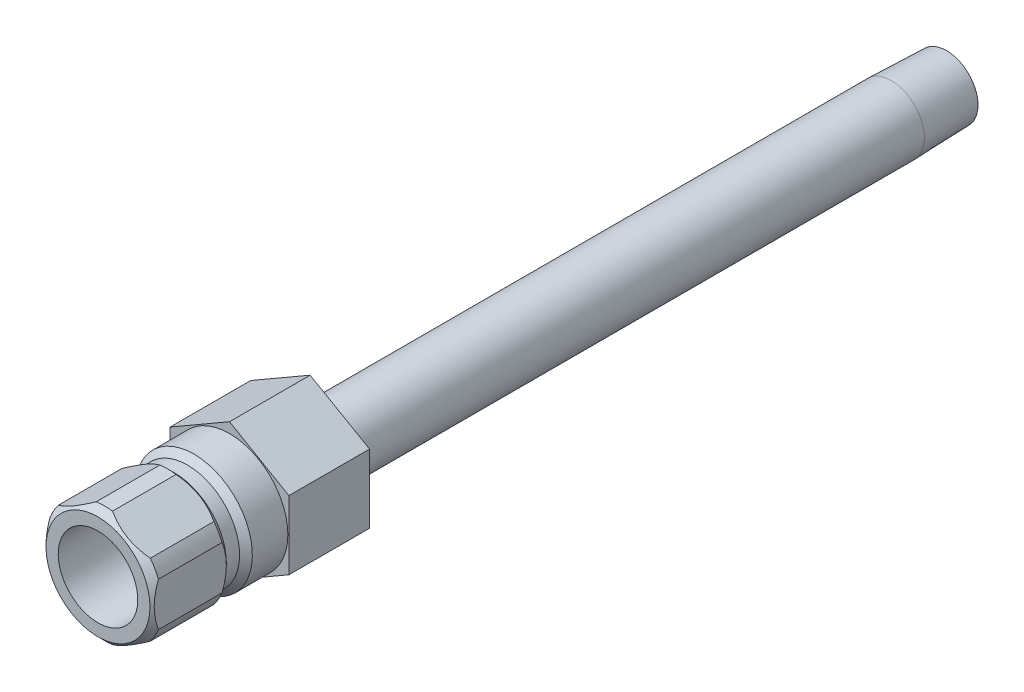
ISO-10303-21;
HEADER;
FILE_DESCRIPTION(('STEP AP214'),'2;1');
FILE_NAME('part.step','',(''),(''),'','','');
FILE_SCHEMA(('AUTOMOTIVE_DESIGN { 1 0 10303 214 1 1 1 1 }'));
ENDSEC;
DATA;
#1=APPLICATION_CONTEXT('core data for automotive mechanical design processes');
#2=APPLICATION_PROTOCOL_DEFINITION('international standard','automotive_design',2000,#1);
#3=PRODUCT_CONTEXT('',#1,'mechanical');
#4=PRODUCT('Part','Part','',(#3));
#5=PRODUCT_RELATED_PRODUCT_CATEGORY('part','',(#4));
#6=PRODUCT_DEFINITION_FORMATION('','',#4);
#7=PRODUCT_DEFINITION_CONTEXT('part definition',#1,'design');
#8=PRODUCT_DEFINITION('design','',#6,#7);
#9=PRODUCT_DEFINITION_SHAPE('','',#8);
#10=(LENGTH_UNIT() NAMED_UNIT(*) SI_UNIT(.MILLI.,.METRE.));
#11=(NAMED_UNIT(*) PLANE_ANGLE_UNIT() SI_UNIT($,.RADIAN.));
#12=(NAMED_UNIT(*) SI_UNIT($,.STERADIAN.) SOLID_ANGLE_UNIT());
#13=UNCERTAINTY_MEASURE_WITH_UNIT(LENGTH_MEASURE(1.E-05),#10,'distance_accuracy_value','');
#14=(GEOMETRIC_REPRESENTATION_CONTEXT(3) GLOBAL_UNCERTAINTY_ASSIGNED_CONTEXT((#13)) GLOBAL_UNIT_ASSIGNED_CONTEXT((#10,
#11,#12)) REPRESENTATION_CONTEXT('',''));
#15=CARTESIAN_POINT('',(0.,0.,0.));
#16=DIRECTION('',(0.,0.,1.));
#17=DIRECTION('',(1.,0.,0.));
#18=AXIS2_PLACEMENT_3D('',#15,#16,#17);
#19=CARTESIAN_POINT('',(0.,0.,-9.652));
#20=DIRECTION('',(0.,0.,-1.));
#21=DIRECTION('',(0.,1.,0.));
#22=AXIS2_PLACEMENT_3D('',#19,#20,#21);
#23=CYLINDRICAL_SURFACE('',#22,6.985);
#24=DIRECTION('',(0.,0.,-1.));
#25=VECTOR('',#24,1.);
#26=CARTESIAN_POINT('',(6.477,2.61509005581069,-9.652));
#27=LINE('',#26,#25);
#28=CARTESIAN_POINT('',(6.477,2.61509005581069,7.366));
#29=VERTEX_POINT('',#28);
#30=CARTESIAN_POINT('',(6.477,2.61509005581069,14.986));
#31=VERTEX_POINT('',#30);
#32=EDGE_CURVE('E381',#29,#31,#27,.F.);
#33=ORIENTED_EDGE('',*,*,#32,.F.);
#34=CARTESIAN_POINT('',(0.,0.,7.366));
#35=DIRECTION('',(0.,0.,-1.));
#36=DIRECTION('',(0.,1.,0.));
#37=AXIS2_PLACEMENT_3D('',#34,#35,#36);
#38=CIRCLE('',#37,6.985);
#39=CARTESIAN_POINT('',(5.50323442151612,4.30170151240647,7.366));
#40=VERTEX_POINT('',#39);
#41=EDGE_CURVE('E190',#40,#29,#38,.T.);
#42=ORIENTED_EDGE('',*,*,#41,.F.);
#43=DIRECTION('',(0.,0.,-1.));
#44=VECTOR('',#43,1.);
#45=CARTESIAN_POINT('',(5.50323442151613,4.30170151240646,-9.652));
#46=LINE('',#45,#44);
#47=CARTESIAN_POINT('',(5.50323442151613,4.30170151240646,14.986));
#48=VERTEX_POINT('',#47);
#49=EDGE_CURVE('E372',#48,#40,#46,.T.);
#50=ORIENTED_EDGE('',*,*,#49,.F.);
#51=CARTESIAN_POINT('',(0.,0.,14.986));
#52=DIRECTION('',(0.,0.,-1.));
#53=DIRECTION('',(0.,1.,0.));
#54=AXIS2_PLACEMENT_3D('',#51,#52,#53);
#55=CIRCLE('',#54,6.985);
#56=EDGE_CURVE('E205',#48,#31,#55,.T.);
#57=ORIENTED_EDGE('',*,*,#56,.T.);
#58=EDGE_LOOP('',(#33,#42,#50,#57));
#59=FACE_BOUND('',#58,.T.);
#60=ADVANCED_FACE('F34',(#59),#23,.T.);
#61=DIRECTION('',(0.,0.,-1.));
#62=VECTOR('',#61,1.);
#63=CARTESIAN_POINT('',(0.973765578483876,6.91679156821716,-9.652));
#64=LINE('',#63,#62);
#65=CARTESIAN_POINT('',(0.973765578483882,6.91679156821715,7.366));
#66=VERTEX_POINT('',#65);
#67=CARTESIAN_POINT('',(0.973765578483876,6.91679156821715,14.986));
#68=VERTEX_POINT('',#67);
#69=EDGE_CURVE('E291',#66,#68,#64,.F.);
#70=ORIENTED_EDGE('',*,*,#69,.F.);
#71=CARTESIAN_POINT('',(-0.973765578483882,6.91679156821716,7.366));
#72=VERTEX_POINT('',#71);
#73=EDGE_CURVE('E194',#72,#66,#38,.T.);
#74=ORIENTED_EDGE('',*,*,#73,.F.);
#75=DIRECTION('',(0.,0.,-1.));
#76=VECTOR('',#75,1.);
#77=CARTESIAN_POINT('',(-0.973765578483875,6.91679156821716,-9.652));
#78=LINE('',#77,#76);
#79=CARTESIAN_POINT('',(-0.973765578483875,6.91679156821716,14.986));
#80=VERTEX_POINT('',#79);
#81=EDGE_CURVE('E54',#80,#72,#78,.T.);
#82=ORIENTED_EDGE('',*,*,#81,.F.);
#83=EDGE_CURVE('E193',#80,#68,#55,.T.);
#84=ORIENTED_EDGE('',*,*,#83,.T.);
#85=EDGE_LOOP('',(#70,#74,#82,#84));
#86=FACE_BOUND('',#85,.T.);
#87=ADVANCED_FACE('F325',(#86),#23,.T.);
#88=DIRECTION('',(0.,0.,-1.));
#89=VECTOR('',#88,1.);
#90=CARTESIAN_POINT('',(-5.50323442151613,4.30170151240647,-9.652));
#91=LINE('',#90,#89);
#92=CARTESIAN_POINT('',(-5.50323442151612,4.30170151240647,7.366));
#93=VERTEX_POINT('',#92);
#94=CARTESIAN_POINT('',(-5.50323442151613,4.30170151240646,14.986));
#95=VERTEX_POINT('',#94);
#96=EDGE_CURVE('E370',#93,#95,#91,.F.);
#97=ORIENTED_EDGE('',*,*,#96,.F.);
#98=CARTESIAN_POINT('',(-6.477,2.6150900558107,7.366));
#99=VERTEX_POINT('',#98);
#100=EDGE_CURVE('E199',#99,#93,#38,.T.);
#101=ORIENTED_EDGE('',*,*,#100,.F.);
#102=DIRECTION('',(0.,0.,-1.));
#103=VECTOR('',#102,1.);
#104=CARTESIAN_POINT('',(-6.477,2.6150900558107,-9.652));
#105=LINE('',#104,#103);
#106=CARTESIAN_POINT('',(-6.477,2.61509005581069,14.986));
#107=VERTEX_POINT('',#106);
#108=EDGE_CURVE('E62',#107,#99,#105,.T.);
#109=ORIENTED_EDGE('',*,*,#108,.F.);
#110=EDGE_CURVE('E204',#107,#95,#55,.T.);
#111=ORIENTED_EDGE('',*,*,#110,.T.);
#112=EDGE_LOOP('',(#97,#101,#109,#111));
#113=FACE_BOUND('',#112,.T.);
#114=ADVANCED_FACE('F330',(#113),#23,.T.);
#115=DIRECTION('',(0.,0.,-1.));
#116=VECTOR('',#115,1.);
#117=CARTESIAN_POINT('',(-6.477,-2.6150900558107,-9.652));
#118=LINE('',#117,#116);
#119=CARTESIAN_POINT('',(-6.477,-2.6150900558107,7.366));
#120=VERTEX_POINT('',#119);
#121=CARTESIAN_POINT('',(-6.477,-2.6150900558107,14.986));
#122=VERTEX_POINT('',#121);
#123=EDGE_CURVE('E362',#120,#122,#118,.F.);
#124=ORIENTED_EDGE('',*,*,#123,.F.);
#125=CARTESIAN_POINT('',(-5.50323442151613,-4.30170151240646,7.366));
#126=VERTEX_POINT('',#125);
#127=EDGE_CURVE('E195',#126,#120,#38,.T.);
#128=ORIENTED_EDGE('',*,*,#127,.F.);
#129=DIRECTION('',(0.,0.,-1.));
#130=VECTOR('',#129,1.);
#131=CARTESIAN_POINT('',(-5.50323442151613,-4.30170151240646,-9.652));
#132=LINE('',#131,#130);
#133=CARTESIAN_POINT('',(-5.50323442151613,-4.30170151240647,14.986));
#134=VERTEX_POINT('',#133);
#135=EDGE_CURVE('E245',#134,#126,#132,.T.);
#136=ORIENTED_EDGE('',*,*,#135,.F.);
#137=EDGE_CURVE('E376',#134,#122,#55,.T.);
#138=ORIENTED_EDGE('',*,*,#137,.T.);
#139=EDGE_LOOP('',(#124,#128,#136,#138));
#140=FACE_BOUND('',#139,.T.);
#141=ADVANCED_FACE('F340',(#140),#23,.T.);
#142=DIRECTION('',(0.,0.,-1.));
#143=VECTOR('',#142,1.);
#144=CARTESIAN_POINT('',(-0.97376557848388,-6.91679156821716,-9.652));
#145=LINE('',#144,#143);
#146=CARTESIAN_POINT('',(-0.973765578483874,-6.91679156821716,7.366));
#147=VERTEX_POINT('',#146);
#148=CARTESIAN_POINT('',(-0.97376557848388,-6.91679156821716,14.986));
#149=VERTEX_POINT('',#148);
#150=EDGE_CURVE('E351',#147,#149,#145,.F.);
#151=ORIENTED_EDGE('',*,*,#150,.F.);
#152=CARTESIAN_POINT('',(0.973765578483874,-6.91679156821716,7.366));
#153=VERTEX_POINT('',#152);
#154=EDGE_CURVE('E191',#153,#147,#38,.T.);
#155=ORIENTED_EDGE('',*,*,#154,.F.);
#156=DIRECTION('',(0.,0.,-1.));
#157=VECTOR('',#156,1.);
#158=CARTESIAN_POINT('',(0.973765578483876,-6.91679156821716,-9.652));
#159=LINE('',#158,#157);
#160=CARTESIAN_POINT('',(0.973765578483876,-6.91679156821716,14.986));
#161=VERTEX_POINT('',#160);
#162=EDGE_CURVE('E168',#161,#153,#159,.T.);
#163=ORIENTED_EDGE('',*,*,#162,.F.);
#164=EDGE_CURVE('E353',#161,#149,#55,.T.);
#165=ORIENTED_EDGE('',*,*,#164,.T.);
#166=EDGE_LOOP('',(#151,#155,#163,#165));
#167=FACE_BOUND('',#166,.T.);
#168=ADVANCED_FACE('F334',(#167),#23,.T.);
#169=CARTESIAN_POINT('',(0.,0.,-9.652));
#170=DIRECTION('',(0.,0.,-1.));
#171=DIRECTION('',(0.,1.,0.));
#172=AXIS2_PLACEMENT_3D('',#169,#170,#171);
#173=CYLINDRICAL_SURFACE('',#172,2.65430000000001);
#174=CARTESIAN_POINT('',(0.,0.,2.43505017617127));
#175=DIRECTION('',(0.,0.,-1.));
#176=DIRECTION('',(0.,1.,0.));
#177=AXIS2_PLACEMENT_3D('',#174,#175,#176);
#178=CIRCLE('',#177,2.6543);
#179=CARTESIAN_POINT('',(0.,2.6543,2.43505017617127));
#180=VERTEX_POINT('',#179);
#181=EDGE_CURVE('E215',#180,#180,#178,.T.);
#182=ORIENTED_EDGE('',*,*,#181,.F.);
#183=EDGE_LOOP('',(#182));
#184=FACE_BOUND('',#183,.T.);
#185=CARTESIAN_POINT('',(0.,0.,-85.852));
#186=DIRECTION('',(0.,0.,-1.));
#187=DIRECTION('',(0.,1.,0.));
#188=AXIS2_PLACEMENT_3D('',#185,#186,#187);
#189=CIRCLE('',#188,2.65430000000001);
#190=CARTESIAN_POINT('',(0.,2.65430000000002,-85.852));
#191=VERTEX_POINT('',#190);
#192=EDGE_CURVE('E429',#191,#191,#189,.T.);
#193=ORIENTED_EDGE('',*,*,#192,.T.);
#194=EDGE_LOOP('',(#193));
#195=FACE_BOUND('',#194,.T.);
#196=ADVANCED_FACE('F36',(#184,#195),#173,.F.);
#197=CARTESIAN_POINT('',(0.,0.,3.556));
#198=DIRECTION('',(0.,0.,1.));
#199=DIRECTION('',(0.,-1.,0.));
#200=AXIS2_PLACEMENT_3D('',#197,#198,#199);
#201=CONICAL_SURFACE('',#200,4.7625,1.08210413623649);
#202=ORIENTED_EDGE('',*,*,#181,.T.);
#203=EDGE_LOOP('',(#202));
#204=FACE_BOUND('',#203,.T.);
#205=CARTESIAN_POINT('',(0.,0.,3.556));
#206=DIRECTION('',(0.,0.,-1.));
#207=DIRECTION('',(0.,1.,0.));
#208=AXIS2_PLACEMENT_3D('',#205,#206,#207);
#209=CIRCLE('',#208,4.7625);
#210=CARTESIAN_POINT('',(0.,4.7625,3.556));
#211=VERTEX_POINT('',#210);
#212=EDGE_CURVE('E212',#211,#211,#209,.T.);
#213=ORIENTED_EDGE('',*,*,#212,.F.);
#214=EDGE_LOOP('',(#213));
#215=FACE_BOUND('',#214,.T.);
#216=ADVANCED_FACE('F346',(#204,#215),#201,.F.);
#217=CARTESIAN_POINT('',(0.,0.,-9.652));
#218=DIRECTION('',(0.,0.,-1.));
#219=DIRECTION('',(0.,1.,0.));
#220=AXIS2_PLACEMENT_3D('',#217,#218,#219);
#221=CYLINDRICAL_SURFACE('',#220,4.7625);
#222=ORIENTED_EDGE('',*,*,#212,.T.);
#223=EDGE_LOOP('',(#222));
#224=FACE_BOUND('',#223,.T.);
#225=CARTESIAN_POINT('',(0.,0.,15.748));
#226=DIRECTION('',(0.,0.,-1.));
#227=DIRECTION('',(0.,1.,0.));
#228=AXIS2_PLACEMENT_3D('',#225,#226,#227);
#229=CIRCLE('',#228,4.7625);
#230=CARTESIAN_POINT('',(0.,4.7625,15.748));
#231=VERTEX_POINT('',#230);
#232=EDGE_CURVE('E209',#231,#231,#229,.T.);
#233=ORIENTED_EDGE('',*,*,#232,.F.);
#234=EDGE_LOOP('',(#233));
#235=FACE_BOUND('',#234,.T.);
#236=ADVANCED_FACE('F671',(#224,#235),#221,.F.);
#237=CARTESIAN_POINT('',(0.,4.7625,15.748));
#238=DIRECTION('',(0.,0.,1.));
#239=DIRECTION('',(0.,-1.,0.));
#240=AXIS2_PLACEMENT_3D('',#237,#238,#239);
#241=PLANE('',#240);
#242=ORIENTED_EDGE('',*,*,#232,.T.);
#243=EDGE_LOOP('',(#242));
#244=FACE_BOUND('',#243,.T.);
#245=CARTESIAN_POINT('',(0.,0.,15.748));
#246=DIRECTION('',(0.,0.,-1.));
#247=DIRECTION('',(0.,1.,0.));
#248=AXIS2_PLACEMENT_3D('',#245,#246,#247);
#249=CIRCLE('',#248,6.223);
#250=CARTESIAN_POINT('',(0.,6.223,15.748));
#251=VERTEX_POINT('',#250);
#252=EDGE_CURVE('E206',#251,#251,#249,.T.);
#253=ORIENTED_EDGE('',*,*,#252,.F.);
#254=EDGE_LOOP('',(#253));
#255=FACE_BOUND('',#254,.T.);
#256=ADVANCED_FACE('F252',(#244,#255),#241,.T.);
#257=CARTESIAN_POINT('',(0.,0.,14.986));
#258=DIRECTION('',(0.,0.,-1.));
#259=DIRECTION('',(0.,1.,0.));
#260=AXIS2_PLACEMENT_3D('',#257,#258,#259);
#261=CONICAL_SURFACE('',#260,6.985,0.785398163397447);
#262=CARTESIAN_POINT('',(6.477,-7.50531717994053,12.0573066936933));
#263=CARTESIAN_POINT('',(6.477,-7.32278230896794,12.1954662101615));
#264=CARTESIAN_POINT('',(6.477,-7.13923073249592,12.3323042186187));
#265=CARTESIAN_POINT('',(6.477,-6.76969107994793,12.6027438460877));
#266=CARTESIAN_POINT('',(6.477,-6.58370240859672,12.7363446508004));
#267=CARTESIAN_POINT('',(6.477,-6.20752484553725,13.0006667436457));
#268=CARTESIAN_POINT('',(6.477,-6.01731457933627,13.1313577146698));
#269=CARTESIAN_POINT('',(6.477,-5.63367369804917,13.3879087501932));
#270=CARTESIAN_POINT('',(6.477,-5.44024331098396,13.5137691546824));
#271=CARTESIAN_POINT('',(6.477,-5.03831720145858,13.7667102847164));
#272=CARTESIAN_POINT('',(6.477,-4.8295984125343,13.8934383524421));
#273=CARTESIAN_POINT('',(6.477,-4.40728395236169,14.1386241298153));
#274=CARTESIAN_POINT('',(6.477,-4.19368750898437,14.2570805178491));
#275=CARTESIAN_POINT('',(6.477,-3.7616267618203,14.4831715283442));
#276=CARTESIAN_POINT('',(6.477,-3.54317924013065,14.5908379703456));
#277=CARTESIAN_POINT('',(6.477,-3.100295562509,14.7929384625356));
#278=CARTESIAN_POINT('',(6.477,-2.87586219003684,14.8873785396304));
#279=CARTESIAN_POINT('',(6.477,-2.43955826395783,15.0524966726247));
#280=CARTESIAN_POINT('',(6.477,-2.22819339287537,15.1244971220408));
#281=CARTESIAN_POINT('',(6.477,-1.80033354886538,15.2515475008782));
#282=CARTESIAN_POINT('',(6.477,-1.58383822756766,15.3065962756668));
#283=CARTESIAN_POINT('',(6.477,-1.1506339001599,15.3959385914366));
#284=CARTESIAN_POINT('',(6.477,-0.934000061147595,15.4305906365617));
#285=CARTESIAN_POINT('',(6.477,-0.498364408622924,15.4784594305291));
#286=CARTESIAN_POINT('',(6.477,-0.279363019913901,15.4916799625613));
#287=CARTESIAN_POINT('',(6.477,0.150697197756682,15.4956835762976));
#288=CARTESIAN_POINT('',(6.477,0.361748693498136,15.4872823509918));
#289=CARTESIAN_POINT('',(6.477,0.782066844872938,15.4503172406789));
#290=CARTESIAN_POINT('',(6.477,0.991333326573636,15.421751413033));
#291=CARTESIAN_POINT('',(6.477,1.41010575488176,15.3455375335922));
#292=CARTESIAN_POINT('',(6.477,1.6195513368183,15.2975631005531));
#293=CARTESIAN_POINT('',(6.477,2.03387291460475,15.1851046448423));
#294=CARTESIAN_POINT('',(6.477,2.2387492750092,15.1206219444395));
#295=CARTESIAN_POINT('',(6.477,2.66141718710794,14.9715598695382));
#296=CARTESIAN_POINT('',(6.477,2.87875617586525,14.8857103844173));
#297=CARTESIAN_POINT('',(6.477,3.30779766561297,14.7008180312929));
#298=CARTESIAN_POINT('',(6.477,3.51949749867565,14.6017690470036));
#299=CARTESIAN_POINT('',(6.477,3.9382898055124,14.3928329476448));
#300=CARTESIAN_POINT('',(6.477,4.14536521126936,14.282911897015));
#301=CARTESIAN_POINT('',(6.477,4.55475391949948,14.0546596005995));
#302=CARTESIAN_POINT('',(6.477,4.75706796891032,13.93632968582));
#303=CARTESIAN_POINT('',(6.477,5.14761370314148,13.6989609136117));
#304=CARTESIAN_POINT('',(6.477,5.33604552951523,13.580249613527));
#305=CARTESIAN_POINT('',(6.477,5.70967381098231,13.3378251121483));
#306=CARTESIAN_POINT('',(6.477,5.89487001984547,13.2141115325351));
#307=CARTESIAN_POINT('',(6.477,6.26095063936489,12.9635958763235));
#308=CARTESIAN_POINT('',(6.477,6.44185783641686,12.8368269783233));
#309=CARTESIAN_POINT('',(6.477,6.80119835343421,12.5799293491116));
#310=CARTESIAN_POINT('',(6.477,6.97963234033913,12.4498015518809));
#311=CARTESIAN_POINT('',(6.477,7.15703038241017,12.3183002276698));
#312=B_SPLINE_CURVE_WITH_KNOTS('',3,(#262,#263,#264,#265,#266,#267,#268,#269,#270,#271,#272,
#273,#274,#275,#276,#277,#278,#279,#280,#281,#282,#283,#284,#285,#286,#287,#288,#289,#290,#291,
#292,#293,#294,#295,#296,#297,#298,#299,#300,#301,#302,#303,#304,#305,#306,#307,#308,#309,#310,
#311),.UNSPECIFIED.,.F.,.F.,(4,2,2,2,2,2,2,2,2,2,2,2,2,2,2,2,2,2,2,2,2,2,2,2,4),(0.,
0.686790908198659,1.37375281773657,2.06603541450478,2.75826919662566,3.49065471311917,
4.22315698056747,4.95343127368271,5.68337170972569,6.35265989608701,7.02199365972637,
7.67918147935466,8.33625327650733,8.96890298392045,9.6016136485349,10.2454384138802,
10.8892116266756,11.5897073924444,12.2905288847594,12.9936114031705,13.6965828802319,
14.3646145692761,15.0326968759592,15.6953618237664,16.3578444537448),.UNSPECIFIED.);
#313=CARTESIAN_POINT('',(6.477,-2.61509005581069,14.986));
#314=VERTEX_POINT('',#313);
#315=EDGE_CURVE('E384',#31,#314,#312,.F.);
#316=ORIENTED_EDGE('',*,*,#315,.F.);
#317=ORIENTED_EDGE('',*,*,#56,.F.);
#318=CARTESIAN_POINT('',(0.973302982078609,6.91705864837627,14.9858));
#319=CARTESIAN_POINT('',(1.15430521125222,6.81255696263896,15.0641166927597));
#320=CARTESIAN_POINT('',(1.33782092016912,6.70660411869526,15.1353544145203));
#321=CARTESIAN_POINT('',(1.70963160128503,6.49193912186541,15.2608524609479));
#322=CARTESIAN_POINT('',(1.89793754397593,6.38322063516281,15.3150691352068));
#323=CARTESIAN_POINT('',(2.27146153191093,6.16756646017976,15.401724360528));
#324=CARTESIAN_POINT('',(2.45655498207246,6.06070270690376,15.4348622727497));
#325=CARTESIAN_POINT('',(2.82844640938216,5.8459910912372,15.4802195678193));
#326=CARTESIAN_POINT('',(3.01524193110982,5.73814464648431,15.4924653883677));
#327=CARTESIAN_POINT('',(3.39480578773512,5.51900335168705,15.4953056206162));
#328=CARTESIAN_POINT('',(3.58757842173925,5.40770601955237,15.4852117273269));
#329=CARTESIAN_POINT('',(3.97148128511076,5.18605959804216,15.4426708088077));
#330=CARTESIAN_POINT('',(4.16260891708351,5.07571200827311,15.4101933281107));
#331=CARTESIAN_POINT('',(4.54854122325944,4.85289388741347,15.3234273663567));
#332=CARTESIAN_POINT('',(4.74321398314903,4.74049951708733,15.268364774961));
#333=CARTESIAN_POINT('',(5.03141021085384,4.57410934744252,15.1720079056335));
#334=CARTESIAN_POINT('',(5.12673323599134,4.51907457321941,15.1376422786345));
#335=CARTESIAN_POINT('',(5.31613879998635,4.40972121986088,15.0647445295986));
#336=CARTESIAN_POINT('',(5.41022179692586,4.35540237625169,15.0262139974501));
#337=CARTESIAN_POINT('',(5.5036970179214,4.30143443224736,14.9858));
#338=B_SPLINE_CURVE_WITH_KNOTS('',3,(#318,#319,#320,#321,#322,#323,#324,#325,#326,#327,#328,
#329,#330,#331,#332,#333,#334,#335,#336,#337),.UNSPECIFIED.,.F.,.F.,(4,2,2,2,2,2,2,2,2,4),(0.,
0.669810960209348,1.34132587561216,1.9892054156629,2.63626449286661,3.30353665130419,
3.97171850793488,4.6650216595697,5.01088265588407,5.3566120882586),.UNSPECIFIED.);
#339=EDGE_CURVE('E283',#68,#48,#338,.T.);
#340=ORIENTED_EDGE('',*,*,#339,.F.);
#341=ORIENTED_EDGE('',*,*,#83,.F.);
#342=CARTESIAN_POINT('',(-5.50369701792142,4.30143443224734,14.9858));
#343=CARTESIAN_POINT('',(-5.32269478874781,4.40593611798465,15.0641166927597));
#344=CARTESIAN_POINT('',(-5.1391790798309,4.51188896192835,15.1353544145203));
#345=CARTESIAN_POINT('',(-4.76736839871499,4.7265539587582,15.2608524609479));
#346=CARTESIAN_POINT('',(-4.57906245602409,4.8352724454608,15.3150691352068));
#347=CARTESIAN_POINT('',(-4.20553846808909,5.05092662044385,15.401724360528));
#348=CARTESIAN_POINT('',(-4.02044501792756,5.15779037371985,15.4348622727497));
#349=CARTESIAN_POINT('',(-3.64855359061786,5.37250198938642,15.4802195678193));
#350=CARTESIAN_POINT('',(-3.4617580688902,5.4803484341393,15.4924653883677));
#351=CARTESIAN_POINT('',(-3.0821942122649,5.69948972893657,15.4953056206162));
#352=CARTESIAN_POINT('',(-2.88942157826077,5.81078706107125,15.4852117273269));
#353=CARTESIAN_POINT('',(-2.50551871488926,6.03243348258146,15.4426708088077));
#354=CARTESIAN_POINT('',(-2.3143910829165,6.1427810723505,15.4101933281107));
#355=CARTESIAN_POINT('',(-1.92845877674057,6.36559919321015,15.3234273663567));
#356=CARTESIAN_POINT('',(-1.73378601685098,6.47799356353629,15.268364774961));
#357=CARTESIAN_POINT('',(-1.44558978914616,6.6443837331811,15.1720079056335));
#358=CARTESIAN_POINT('',(-1.35026676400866,6.69941850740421,15.1376422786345));
#359=CARTESIAN_POINT('',(-1.16086120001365,6.80877186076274,15.0647445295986));
#360=CARTESIAN_POINT('',(-1.06677820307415,6.86309070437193,15.0262139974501));
#361=CARTESIAN_POINT('',(-0.973302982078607,6.91705864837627,14.9858));
#362=B_SPLINE_CURVE_WITH_KNOTS('',3,(#342,#343,#344,#345,#346,#347,#348,#349,#350,#351,#352,
#353,#354,#355,#356,#357,#358,#359,#360,#361),.UNSPECIFIED.,.F.,.F.,(4,2,2,2,2,2,2,2,2,4),(0.,
0.669810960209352,1.34132587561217,1.98920541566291,2.63626449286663,3.30353665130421,
3.9717185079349,4.66502165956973,5.0108826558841,5.35661208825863),.UNSPECIFIED.);
#363=EDGE_CURVE('E275',#95,#80,#362,.T.);
#364=ORIENTED_EDGE('',*,*,#363,.F.);
#365=ORIENTED_EDGE('',*,*,#110,.F.);
#366=CARTESIAN_POINT('',(-6.477,-7.50531717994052,12.0573066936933));
#367=CARTESIAN_POINT('',(-6.477,-7.32278230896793,12.1954662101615));
#368=CARTESIAN_POINT('',(-6.477,-7.13923073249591,12.3323042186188));
#369=CARTESIAN_POINT('',(-6.477,-6.76969107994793,12.6027438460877));
#370=CARTESIAN_POINT('',(-6.477,-6.58370240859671,12.7363446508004));
#371=CARTESIAN_POINT('',(-6.477,-6.20752484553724,13.0006667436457));
#372=CARTESIAN_POINT('',(-6.477,-6.01731457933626,13.1313577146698));
#373=CARTESIAN_POINT('',(-6.477,-5.63367369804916,13.3879087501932));
#374=CARTESIAN_POINT('',(-6.477,-5.44024331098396,13.5137691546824));
#375=CARTESIAN_POINT('',(-6.477,-5.03831720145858,13.7667102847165));
#376=CARTESIAN_POINT('',(-6.477,-4.82959841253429,13.8934383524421));
#377=CARTESIAN_POINT('',(-6.477,-4.40728395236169,14.1386241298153));
#378=CARTESIAN_POINT('',(-6.477,-4.19368750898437,14.2570805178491));
#379=CARTESIAN_POINT('',(-6.477,-3.7616267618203,14.4831715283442));
#380=CARTESIAN_POINT('',(-6.477,-3.54317924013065,14.5908379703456));
#381=CARTESIAN_POINT('',(-6.477,-3.100295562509,14.7929384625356));
#382=CARTESIAN_POINT('',(-6.477,-2.87586219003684,14.8873785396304));
#383=CARTESIAN_POINT('',(-6.477,-2.43955826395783,15.0524966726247));
#384=CARTESIAN_POINT('',(-6.477,-2.22819339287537,15.1244971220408));
#385=CARTESIAN_POINT('',(-6.477,-1.80033354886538,15.2515475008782));
#386=CARTESIAN_POINT('',(-6.477,-1.58383822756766,15.3065962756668));
#387=CARTESIAN_POINT('',(-6.477,-1.15063390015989,15.3959385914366));
#388=CARTESIAN_POINT('',(-6.477,-0.934000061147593,15.4305906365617));
#389=CARTESIAN_POINT('',(-6.477,-0.498364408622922,15.4784594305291));
#390=CARTESIAN_POINT('',(-6.477,-0.279363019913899,15.4916799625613));
#391=CARTESIAN_POINT('',(-6.477,0.150697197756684,15.4956835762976));
#392=CARTESIAN_POINT('',(-6.477,0.361748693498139,15.4872823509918));
#393=CARTESIAN_POINT('',(-6.477,0.78206684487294,15.4503172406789));
#394=CARTESIAN_POINT('',(-6.477,0.991333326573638,15.421751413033));
#395=CARTESIAN_POINT('',(-6.477,1.41010575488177,15.3455375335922));
#396=CARTESIAN_POINT('',(-6.477,1.6195513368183,15.2975631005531));
#397=CARTESIAN_POINT('',(-6.477,2.03387291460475,15.1851046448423));
#398=CARTESIAN_POINT('',(-6.477,2.2387492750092,15.1206219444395));
#399=CARTESIAN_POINT('',(-6.477,2.66141718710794,14.9715598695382));
#400=CARTESIAN_POINT('',(-6.477,2.87875617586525,14.8857103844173));
#401=CARTESIAN_POINT('',(-6.477,3.30779766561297,14.7008180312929));
#402=CARTESIAN_POINT('',(-6.477,3.51949749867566,14.6017690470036));
#403=CARTESIAN_POINT('',(-6.477,3.9382898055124,14.3928329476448));
#404=CARTESIAN_POINT('',(-6.477,4.14536521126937,14.282911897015));
#405=CARTESIAN_POINT('',(-6.477,4.55475391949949,14.0546596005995));
#406=CARTESIAN_POINT('',(-6.477,4.75706796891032,13.93632968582));
#407=CARTESIAN_POINT('',(-6.477,5.14761370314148,13.6989609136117));
#408=CARTESIAN_POINT('',(-6.477,5.33604552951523,13.580249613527));
#409=CARTESIAN_POINT('',(-6.477,5.70967381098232,13.3378251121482));
#410=CARTESIAN_POINT('',(-6.477,5.89487001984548,13.2141115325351));
#411=CARTESIAN_POINT('',(-6.477,6.26095063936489,12.9635958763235));
#412=CARTESIAN_POINT('',(-6.477,6.44185783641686,12.8368269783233));
#413=CARTESIAN_POINT('',(-6.477,6.80119835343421,12.5799293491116));
#414=CARTESIAN_POINT('',(-6.477,6.97963234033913,12.4498015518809));
#415=CARTESIAN_POINT('',(-6.477,7.15703038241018,12.3183002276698));
#416=B_SPLINE_CURVE_WITH_KNOTS('',3,(#366,#367,#368,#369,#370,#371,#372,#373,#374,#375,#376,
#377,#378,#379,#380,#381,#382,#383,#384,#385,#386,#387,#388,#389,#390,#391,#392,#393,#394,#395,
#396,#397,#398,#399,#400,#401,#402,#403,#404,#405,#406,#407,#408,#409,#410,#411,#412,#413,#414,
#415),.UNSPECIFIED.,.F.,.F.,(4,2,2,2,2,2,2,2,2,2,2,2,2,2,2,2,2,2,2,2,2,2,2,2,4),(0.,
0.686790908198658,1.37375281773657,2.06603541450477,2.75826919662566,3.49065471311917,
4.22315698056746,4.95343127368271,5.68337170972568,6.352659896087,7.02199365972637,
7.67918147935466,8.33625327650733,8.96890298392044,9.6016136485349,10.2454384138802,
10.8892116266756,11.5897073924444,12.2905288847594,12.9936114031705,13.6965828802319,
14.3646145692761,15.0326968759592,15.6953618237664,16.3578444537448),.UNSPECIFIED.);
#417=EDGE_CURVE('E268',#122,#107,#416,.T.);
#418=ORIENTED_EDGE('',*,*,#417,.F.);
#419=ORIENTED_EDGE('',*,*,#137,.F.);
#420=CARTESIAN_POINT('',(-0.973302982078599,-6.91705864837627,14.9858));
#421=CARTESIAN_POINT('',(-1.15430521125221,-6.81255696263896,15.0641166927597));
#422=CARTESIAN_POINT('',(-1.33782092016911,-6.70660411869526,15.1353544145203));
#423=CARTESIAN_POINT('',(-1.70963160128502,-6.49193912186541,15.2608524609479));
#424=CARTESIAN_POINT('',(-1.89793754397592,-6.38322063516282,15.3150691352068));
#425=CARTESIAN_POINT('',(-2.27146153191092,-6.16756646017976,15.401724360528));
#426=CARTESIAN_POINT('',(-2.45655498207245,-6.06070270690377,15.4348622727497));
#427=CARTESIAN_POINT('',(-2.82844640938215,-5.8459910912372,15.4802195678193));
#428=CARTESIAN_POINT('',(-3.01524193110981,-5.73814464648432,15.4924653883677));
#429=CARTESIAN_POINT('',(-3.39480578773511,-5.51900335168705,15.4953056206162));
#430=CARTESIAN_POINT('',(-3.58757842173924,-5.40770601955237,15.4852117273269));
#431=CARTESIAN_POINT('',(-3.97148128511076,-5.18605959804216,15.4426708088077));
#432=CARTESIAN_POINT('',(-4.16260891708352,-5.07571200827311,15.4101933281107));
#433=CARTESIAN_POINT('',(-4.54854122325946,-4.85289388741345,15.3234273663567));
#434=CARTESIAN_POINT('',(-4.74321398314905,-4.74049951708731,15.268364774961));
#435=CARTESIAN_POINT('',(-5.03141021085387,-4.5741093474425,15.1720079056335));
#436=CARTESIAN_POINT('',(-5.12673323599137,-4.51907457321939,15.1376422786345));
#437=CARTESIAN_POINT('',(-5.31613879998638,-4.40972121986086,15.0647445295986));
#438=CARTESIAN_POINT('',(-5.41022179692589,-4.35540237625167,15.0262139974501));
#439=CARTESIAN_POINT('',(-5.50369701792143,-4.30143443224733,14.9858));
#440=B_SPLINE_CURVE_WITH_KNOTS('',3,(#420,#421,#422,#423,#424,#425,#426,#427,#428,#429,#430,
#431,#432,#433,#434,#435,#436,#437,#438,#439),.UNSPECIFIED.,.F.,.F.,(4,2,2,2,2,2,2,2,2,4),(0.,
0.669810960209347,1.34132587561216,1.9892054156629,2.63626449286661,3.3035366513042,
3.97171850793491,4.66502165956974,5.01088265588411,5.35661208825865),.UNSPECIFIED.);
#441=EDGE_CURVE('E261',#149,#134,#440,.T.);
#442=ORIENTED_EDGE('',*,*,#441,.F.);
#443=ORIENTED_EDGE('',*,*,#164,.F.);
#444=CARTESIAN_POINT('',(5.5036970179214,-4.30143443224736,14.9858));
#445=CARTESIAN_POINT('',(5.32269478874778,-4.40593611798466,15.0641166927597));
#446=CARTESIAN_POINT('',(5.13917907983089,-4.51188896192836,15.1353544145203));
#447=CARTESIAN_POINT('',(4.76736839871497,-4.72655395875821,15.2608524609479));
#448=CARTESIAN_POINT('',(4.57906245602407,-4.83527244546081,15.3150691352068));
#449=CARTESIAN_POINT('',(4.20553846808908,-5.05092662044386,15.401724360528));
#450=CARTESIAN_POINT('',(4.02044501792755,-5.15779037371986,15.4348622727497));
#451=CARTESIAN_POINT('',(3.64855359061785,-5.37250198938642,15.4802195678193));
#452=CARTESIAN_POINT('',(3.46175806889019,-5.4803484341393,15.4924653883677));
#453=CARTESIAN_POINT('',(3.08219421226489,-5.69948972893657,15.4953056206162));
#454=CARTESIAN_POINT('',(2.88942157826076,-5.81078706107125,15.4852117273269));
#455=CARTESIAN_POINT('',(2.50551871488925,-6.03243348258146,15.4426708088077));
#456=CARTESIAN_POINT('',(2.31439108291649,-6.14278107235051,15.4101933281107));
#457=CARTESIAN_POINT('',(1.92845877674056,-6.36559919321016,15.3234273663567));
#458=CARTESIAN_POINT('',(1.73378601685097,-6.4779935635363,15.268364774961));
#459=CARTESIAN_POINT('',(1.44558978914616,-6.64438373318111,15.1720079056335));
#460=CARTESIAN_POINT('',(1.35026676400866,-6.69941850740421,15.1376422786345));
#461=CARTESIAN_POINT('',(1.16086120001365,-6.80877186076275,15.0647445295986));
#462=CARTESIAN_POINT('',(1.06677820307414,-6.86309070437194,15.0262139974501));
#463=CARTESIAN_POINT('',(0.973302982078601,-6.91705864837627,14.9858));
#464=B_SPLINE_CURVE_WITH_KNOTS('',3,(#444,#445,#446,#447,#448,#449,#450,#451,#452,#453,#454,
#455,#456,#457,#458,#459,#460,#461,#462,#463),.UNSPECIFIED.,.F.,.F.,(4,2,2,2,2,2,2,2,2,4),(0.,
0.669810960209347,1.34132587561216,1.9892054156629,2.63626449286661,3.30353665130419,
3.97171850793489,4.66502165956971,5.01088265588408,5.35661208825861),.UNSPECIFIED.);
#465=CARTESIAN_POINT('',(5.50323442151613,-4.30170151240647,14.986));
#466=VERTEX_POINT('',#465);
#467=EDGE_CURVE('E184',#466,#161,#464,.T.);
#468=ORIENTED_EDGE('',*,*,#467,.F.);
#469=EDGE_CURVE('E183',#314,#466,#55,.T.);
#470=ORIENTED_EDGE('',*,*,#469,.F.);
#471=EDGE_LOOP('',(#316,#317,#340,#341,#364,#365,#418,#419,#442,#443,#468,#470));
#472=FACE_BOUND('',#471,.T.);
#473=ORIENTED_EDGE('',*,*,#252,.T.);
#474=EDGE_LOOP('',(#473));
#475=FACE_BOUND('',#474,.T.);
#476=ADVANCED_FACE('F248',(#472,#475),#261,.T.);
#477=DIRECTION('',(0.,0.,-1.));
#478=VECTOR('',#477,1.);
#479=CARTESIAN_POINT('',(6.477,-2.61509005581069,-9.652));
#480=LINE('',#479,#478);
#481=CARTESIAN_POINT('',(6.477,-2.61509005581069,7.366));
#482=VERTEX_POINT('',#481);
#483=EDGE_CURVE('E290',#314,#482,#480,.T.);
#484=ORIENTED_EDGE('',*,*,#483,.F.);
#485=ORIENTED_EDGE('',*,*,#469,.T.);
#486=DIRECTION('',(0.,0.,-1.));
#487=VECTOR('',#486,1.);
#488=CARTESIAN_POINT('',(5.50323442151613,-4.30170151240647,-9.652));
#489=LINE('',#488,#487);
#490=CARTESIAN_POINT('',(5.50323442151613,-4.30170151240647,7.366));
#491=VERTEX_POINT('',#490);
#492=EDGE_CURVE('E165',#491,#466,#489,.F.);
#493=ORIENTED_EDGE('',*,*,#492,.F.);
#494=EDGE_CURVE('E181',#482,#491,#38,.T.);
#495=ORIENTED_EDGE('',*,*,#494,.F.);
#496=EDGE_LOOP('',(#484,#485,#493,#495));
#497=FACE_BOUND('',#496,.T.);
#498=ADVANCED_FACE('F180',(#497),#23,.T.);
#499=CARTESIAN_POINT('',(0.,0.,6.604));
#500=DIRECTION('',(0.,0.,1.));
#501=DIRECTION('',(0.,-1.,0.));
#502=AXIS2_PLACEMENT_3D('',#499,#500,#501);
#503=CONICAL_SURFACE('',#502,6.223,0.785398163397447);
#504=CARTESIAN_POINT('',(6.477,-7.50531717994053,10.2946933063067));
#505=CARTESIAN_POINT('',(6.477,-7.32278230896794,10.1565337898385));
#506=CARTESIAN_POINT('',(6.477,-7.13923073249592,10.0196957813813));
#507=CARTESIAN_POINT('',(6.477,-6.76969107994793,9.74925615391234));
#508=CARTESIAN_POINT('',(6.477,-6.58370240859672,9.61565534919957));
#509=CARTESIAN_POINT('',(6.477,-6.20752484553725,9.35133325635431));
#510=CARTESIAN_POINT('',(6.477,-6.01731457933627,9.22064228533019));
#511=CARTESIAN_POINT('',(6.477,-5.63367369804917,8.96409124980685));
#512=CARTESIAN_POINT('',(6.477,-5.44024331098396,8.83823084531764));
#513=CARTESIAN_POINT('',(6.477,-5.03831720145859,8.58528971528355));
#514=CARTESIAN_POINT('',(6.477,-4.8295984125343,8.45856164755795));
#515=CARTESIAN_POINT('',(6.477,-4.4072839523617,8.21337587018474));
#516=CARTESIAN_POINT('',(6.477,-4.19368750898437,8.09491948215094));
#517=CARTESIAN_POINT('',(6.477,-3.7616267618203,7.8688284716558));
#518=CARTESIAN_POINT('',(6.477,-3.54317924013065,7.76116202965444));
#519=CARTESIAN_POINT('',(6.477,-3.100295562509,7.55906153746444));
#520=CARTESIAN_POINT('',(6.477,-2.87586219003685,7.46462146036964));
#521=CARTESIAN_POINT('',(6.477,-2.43955826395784,7.2995033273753));
#522=CARTESIAN_POINT('',(6.477,-2.22819339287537,7.2275028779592));
#523=CARTESIAN_POINT('',(6.477,-1.80033354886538,7.1004524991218));
#524=CARTESIAN_POINT('',(6.477,-1.58383822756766,7.0454037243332));
#525=CARTESIAN_POINT('',(6.477,-1.1506339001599,6.95606140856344));
#526=CARTESIAN_POINT('',(6.477,-0.934000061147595,6.9214093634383));
#527=CARTESIAN_POINT('',(6.477,-0.498364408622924,6.87354056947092));
#528=CARTESIAN_POINT('',(6.477,-0.279363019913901,6.86032003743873));
#529=CARTESIAN_POINT('',(6.477,0.150697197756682,6.85631642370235));
#530=CARTESIAN_POINT('',(6.477,0.361748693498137,6.86471764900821));
#531=CARTESIAN_POINT('',(6.477,0.78206684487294,6.90168275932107));
#532=CARTESIAN_POINT('',(6.477,0.991333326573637,6.93024858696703));
#533=CARTESIAN_POINT('',(6.477,1.41010575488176,7.00646246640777));
#534=CARTESIAN_POINT('',(6.477,1.6195513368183,7.05443689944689));
#535=CARTESIAN_POINT('',(6.477,2.03387291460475,7.16689535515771));
#536=CARTESIAN_POINT('',(6.477,2.2387492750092,7.2313780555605));
#537=CARTESIAN_POINT('',(6.477,2.66141718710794,7.38044013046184));
#538=CARTESIAN_POINT('',(6.477,2.87875617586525,7.46628961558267));
#539=CARTESIAN_POINT('',(6.477,3.30779766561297,7.65118196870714));
#540=CARTESIAN_POINT('',(6.477,3.51949749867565,7.75023095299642));
#541=CARTESIAN_POINT('',(6.477,3.9382898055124,7.95916705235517));
#542=CARTESIAN_POINT('',(6.477,4.14536521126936,8.06908810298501));
#543=CARTESIAN_POINT('',(6.477,4.55475391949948,8.29734039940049));
#544=CARTESIAN_POINT('',(6.477,4.75706796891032,8.41567031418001));
#545=CARTESIAN_POINT('',(6.477,5.14761370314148,8.65303908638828));
#546=CARTESIAN_POINT('',(6.477,5.33604552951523,8.77175038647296));
#547=CARTESIAN_POINT('',(6.477,5.70967381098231,9.01417488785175));
#548=CARTESIAN_POINT('',(6.477,5.89487001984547,9.13788846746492));
#549=CARTESIAN_POINT('',(6.477,6.26095063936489,9.38840412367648));
#550=CARTESIAN_POINT('',(6.477,6.44185783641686,9.51517302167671));
#551=CARTESIAN_POINT('',(6.477,6.80119835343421,9.77207065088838));
#552=CARTESIAN_POINT('',(6.477,6.97963234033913,9.90219844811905));
#553=CARTESIAN_POINT('',(6.477,7.15703038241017,10.0336997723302));
#554=B_SPLINE_CURVE_WITH_KNOTS('',3,(#504,#505,#506,#507,#508,#509,#510,#511,#512,#513,#514,
#515,#516,#517,#518,#519,#520,#521,#522,#523,#524,#525,#526,#527,#528,#529,#530,#531,#532,#533,
#534,#535,#536,#537,#538,#539,#540,#541,#542,#543,#544,#545,#546,#547,#548,#549,#550,#551,#552,
#553),.UNSPECIFIED.,.F.,.F.,(4,2,2,2,2,2,2,2,2,2,2,2,2,2,2,2,2,2,2,2,2,2,2,2,4),(0.,
0.686790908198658,1.37375281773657,2.06603541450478,2.75826919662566,3.49065471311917,
4.22315698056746,4.95343127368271,5.68337170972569,6.35265989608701,7.02199365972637,
7.67918147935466,8.33625327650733,8.96890298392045,9.6016136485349,10.2454384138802,
10.8892116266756,11.5897073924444,12.2905288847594,12.9936114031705,13.6965828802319,
14.3646145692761,15.0326968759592,15.6953618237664,16.3578444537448),.UNSPECIFIED.);
#555=EDGE_CURVE('E12',#482,#29,#554,.T.);
#556=ORIENTED_EDGE('',*,*,#555,.F.);
#557=ORIENTED_EDGE('',*,*,#494,.T.);
#558=CARTESIAN_POINT('',(0.973302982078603,-6.91705864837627,7.3662));
#559=CARTESIAN_POINT('',(1.15430521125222,-6.81255696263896,7.28788330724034));
#560=CARTESIAN_POINT('',(1.33782092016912,-6.70660411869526,7.21664558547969));
#561=CARTESIAN_POINT('',(1.70963160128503,-6.49193912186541,7.09114753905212));
#562=CARTESIAN_POINT('',(1.89793754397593,-6.38322063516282,7.03693086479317));
#563=CARTESIAN_POINT('',(2.27146153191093,-6.16756646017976,6.95027563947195));
#564=CARTESIAN_POINT('',(2.45655498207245,-6.06070270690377,6.91713772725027));
#565=CARTESIAN_POINT('',(2.82844640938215,-5.8459910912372,6.87178043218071));
#566=CARTESIAN_POINT('',(3.01524193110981,-5.73814464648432,6.85953461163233));
#567=CARTESIAN_POINT('',(3.39480578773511,-5.51900335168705,6.85669437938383));
#568=CARTESIAN_POINT('',(3.58757842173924,-5.40770601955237,6.86678827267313));
#569=CARTESIAN_POINT('',(3.97148128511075,-5.18605959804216,6.90932919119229));
#570=CARTESIAN_POINT('',(4.16260891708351,-5.07571200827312,6.9418066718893));
#571=CARTESIAN_POINT('',(4.54854122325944,-4.85289388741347,7.02857263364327));
#572=CARTESIAN_POINT('',(4.74321398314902,-4.74049951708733,7.08363522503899));
#573=CARTESIAN_POINT('',(5.03141021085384,-4.57410934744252,7.17999209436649));
#574=CARTESIAN_POINT('',(5.12673323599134,-4.51907457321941,7.21435772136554));
#575=CARTESIAN_POINT('',(5.31613879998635,-4.40972121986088,7.28725547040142));
#576=CARTESIAN_POINT('',(5.41022179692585,-4.35540237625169,7.32578600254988));
#577=CARTESIAN_POINT('',(5.50369701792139,-4.30143443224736,7.3662));
#578=B_SPLINE_CURVE_WITH_KNOTS('',3,(#558,#559,#560,#561,#562,#563,#564,#565,#566,#567,#568,
#569,#570,#571,#572,#573,#574,#575,#576,#577),.UNSPECIFIED.,.F.,.F.,(4,2,2,2,2,2,2,2,2,4),(0.,
0.669810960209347,1.34132587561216,1.9892054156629,2.63626449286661,3.30353665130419,
3.97171850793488,4.6650216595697,5.01088265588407,5.3566120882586),.UNSPECIFIED.);
#579=EDGE_CURVE('E162',#153,#491,#578,.T.);
#580=ORIENTED_EDGE('',*,*,#579,.F.);
#581=ORIENTED_EDGE('',*,*,#154,.T.);
#582=CARTESIAN_POINT('',(-5.50369701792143,-4.30143443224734,7.36620000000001));
#583=CARTESIAN_POINT('',(-5.32269478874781,-4.40593611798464,7.28788330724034));
#584=CARTESIAN_POINT('',(-5.13917907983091,-4.51188896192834,7.2166455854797));
#585=CARTESIAN_POINT('',(-4.767368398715,-4.72655395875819,7.09114753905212));
#586=CARTESIAN_POINT('',(-4.5790624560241,-4.83527244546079,7.03693086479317));
#587=CARTESIAN_POINT('',(-4.2055384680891,-5.05092662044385,6.95027563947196));
#588=CARTESIAN_POINT('',(-4.02044501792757,-5.15779037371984,6.91713772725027));
#589=CARTESIAN_POINT('',(-3.64855359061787,-5.37250198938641,6.87178043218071));
#590=CARTESIAN_POINT('',(-3.46175806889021,-5.48034843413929,6.85953461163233));
#591=CARTESIAN_POINT('',(-3.08219421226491,-5.69948972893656,6.85669437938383));
#592=CARTESIAN_POINT('',(-2.88942157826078,-5.81078706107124,6.86678827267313));
#593=CARTESIAN_POINT('',(-2.50551871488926,-6.03243348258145,6.90932919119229));
#594=CARTESIAN_POINT('',(-2.3143910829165,-6.1427810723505,6.94180667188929));
#595=CARTESIAN_POINT('',(-1.92845877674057,-6.36559919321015,7.02857263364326));
#596=CARTESIAN_POINT('',(-1.73378601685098,-6.47799356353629,7.08363522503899));
#597=CARTESIAN_POINT('',(-1.44558978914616,-6.6443837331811,7.17999209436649));
#598=CARTESIAN_POINT('',(-1.35026676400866,-6.69941850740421,7.21435772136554));
#599=CARTESIAN_POINT('',(-1.16086120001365,-6.80877186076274,7.28725547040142));
#600=CARTESIAN_POINT('',(-1.06677820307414,-6.86309070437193,7.32578600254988));
#601=CARTESIAN_POINT('',(-0.973302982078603,-6.91705864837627,7.3662));
#602=B_SPLINE_CURVE_WITH_KNOTS('',3,(#582,#583,#584,#585,#586,#587,#588,#589,#590,#591,#592,
#593,#594,#595,#596,#597,#598,#599,#600,#601),.UNSPECIFIED.,.F.,.F.,(4,2,2,2,2,2,2,2,2,4),(0.,
0.669810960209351,1.34132587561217,1.98920541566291,2.63626449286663,3.30353665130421,
3.97171850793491,4.66502165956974,5.01088265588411,5.35661208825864),.UNSPECIFIED.);
#603=EDGE_CURVE('E173',#126,#147,#602,.T.);
#604=ORIENTED_EDGE('',*,*,#603,.F.);
#605=ORIENTED_EDGE('',*,*,#127,.T.);
#606=CARTESIAN_POINT('',(-6.477,-7.50531717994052,10.2946933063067));
#607=CARTESIAN_POINT('',(-6.477,-7.32278230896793,10.1565337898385));
#608=CARTESIAN_POINT('',(-6.477,-7.13923073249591,10.0196957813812));
#609=CARTESIAN_POINT('',(-6.477,-6.76969107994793,9.74925615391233));
#610=CARTESIAN_POINT('',(-6.477,-6.58370240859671,9.61565534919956));
#611=CARTESIAN_POINT('',(-6.477,-6.20752484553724,9.35133325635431));
#612=CARTESIAN_POINT('',(-6.477,-6.01731457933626,9.22064228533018));
#613=CARTESIAN_POINT('',(-6.477,-5.63367369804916,8.96409124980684));
#614=CARTESIAN_POINT('',(-6.477,-5.44024331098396,8.83823084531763));
#615=CARTESIAN_POINT('',(-6.477,-5.03831720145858,8.58528971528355));
#616=CARTESIAN_POINT('',(-6.477,-4.82959841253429,8.45856164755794));
#617=CARTESIAN_POINT('',(-6.477,-4.40728395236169,8.21337587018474));
#618=CARTESIAN_POINT('',(-6.477,-4.19368750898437,8.09491948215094));
#619=CARTESIAN_POINT('',(-6.477,-3.7616267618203,7.8688284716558));
#620=CARTESIAN_POINT('',(-6.477,-3.54317924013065,7.76116202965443));
#621=CARTESIAN_POINT('',(-6.477,-3.100295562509,7.55906153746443));
#622=CARTESIAN_POINT('',(-6.477,-2.87586219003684,7.46462146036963));
#623=CARTESIAN_POINT('',(-6.477,-2.43955826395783,7.2995033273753));
#624=CARTESIAN_POINT('',(-6.477,-2.22819339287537,7.2275028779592));
#625=CARTESIAN_POINT('',(-6.477,-1.80033354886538,7.1004524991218));
#626=CARTESIAN_POINT('',(-6.477,-1.58383822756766,7.0454037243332));
#627=CARTESIAN_POINT('',(-6.477,-1.15063390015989,6.95606140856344));
#628=CARTESIAN_POINT('',(-6.477,-0.934000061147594,6.92140936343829));
#629=CARTESIAN_POINT('',(-6.477,-0.498364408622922,6.87354056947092));
#630=CARTESIAN_POINT('',(-6.477,-0.279363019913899,6.86032003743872));
#631=CARTESIAN_POINT('',(-6.477,0.150697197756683,6.85631642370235));
#632=CARTESIAN_POINT('',(-6.477,0.361748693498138,6.8647176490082));
#633=CARTESIAN_POINT('',(-6.477,0.78206684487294,6.90168275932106));
#634=CARTESIAN_POINT('',(-6.477,0.991333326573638,6.93024858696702));
#635=CARTESIAN_POINT('',(-6.477,1.41010575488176,7.00646246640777));
#636=CARTESIAN_POINT('',(-6.477,1.6195513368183,7.05443689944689));
#637=CARTESIAN_POINT('',(-6.477,2.03387291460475,7.16689535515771));
#638=CARTESIAN_POINT('',(-6.477,2.2387492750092,7.2313780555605));
#639=CARTESIAN_POINT('',(-6.477,2.66141718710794,7.38044013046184));
#640=CARTESIAN_POINT('',(-6.477,2.87875617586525,7.46628961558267));
#641=CARTESIAN_POINT('',(-6.477,3.30779766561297,7.65118196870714));
#642=CARTESIAN_POINT('',(-6.477,3.51949749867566,7.75023095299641));
#643=CARTESIAN_POINT('',(-6.477,3.9382898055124,7.95916705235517));
#644=CARTESIAN_POINT('',(-6.477,4.14536521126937,8.06908810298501));
#645=CARTESIAN_POINT('',(-6.477,4.55475391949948,8.29734039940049));
#646=CARTESIAN_POINT('',(-6.477,4.75706796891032,8.41567031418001));
#647=CARTESIAN_POINT('',(-6.477,5.14761370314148,8.65303908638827));
#648=CARTESIAN_POINT('',(-6.477,5.33604552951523,8.77175038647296));
#649=CARTESIAN_POINT('',(-6.477,5.70967381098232,9.01417488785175));
#650=CARTESIAN_POINT('',(-6.477,5.89487001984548,9.13788846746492));
#651=CARTESIAN_POINT('',(-6.477,6.26095063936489,9.38840412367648));
#652=CARTESIAN_POINT('',(-6.477,6.44185783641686,9.51517302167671));
#653=CARTESIAN_POINT('',(-6.477,6.80119835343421,9.77207065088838));
#654=CARTESIAN_POINT('',(-6.477,6.97963234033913,9.90219844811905));
#655=CARTESIAN_POINT('',(-6.477,7.15703038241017,10.0336997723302));
#656=B_SPLINE_CURVE_WITH_KNOTS('',3,(#606,#607,#608,#609,#610,#611,#612,#613,#614,#615,#616,
#617,#618,#619,#620,#621,#622,#623,#624,#625,#626,#627,#628,#629,#630,#631,#632,#633,#634,#635,
#636,#637,#638,#639,#640,#641,#642,#643,#644,#645,#646,#647,#648,#649,#650,#651,#652,#653,#654,
#655),.UNSPECIFIED.,.F.,.F.,(4,2,2,2,2,2,2,2,2,2,2,2,2,2,2,2,2,2,2,2,2,2,2,2,4),(0.,
0.686790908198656,1.37375281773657,2.06603541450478,2.75826919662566,3.49065471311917,
4.22315698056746,4.95343127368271,5.68337170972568,6.352659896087,7.02199365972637,
7.67918147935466,8.33625327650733,8.96890298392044,9.6016136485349,10.2454384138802,
10.8892116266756,11.5897073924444,12.2905288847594,12.9936114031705,13.6965828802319,
14.3646145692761,15.0326968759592,15.6953618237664,16.3578444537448),.UNSPECIFIED.);
#657=EDGE_CURVE('E311',#99,#120,#656,.F.);
#658=ORIENTED_EDGE('',*,*,#657,.F.);
#659=ORIENTED_EDGE('',*,*,#100,.T.);
#660=CARTESIAN_POINT('',(-0.973302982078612,6.91705864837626,7.3662));
#661=CARTESIAN_POINT('',(-1.15430521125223,6.81255696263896,7.28788330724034));
#662=CARTESIAN_POINT('',(-1.33782092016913,6.70660411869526,7.21664558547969));
#663=CARTESIAN_POINT('',(-1.70963160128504,6.49193912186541,7.09114753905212));
#664=CARTESIAN_POINT('',(-1.89793754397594,6.38322063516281,7.03693086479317));
#665=CARTESIAN_POINT('',(-2.27146153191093,6.16756646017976,6.95027563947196));
#666=CARTESIAN_POINT('',(-2.45655498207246,6.06070270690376,6.91713772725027));
#667=CARTESIAN_POINT('',(-2.82844640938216,5.8459910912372,6.87178043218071));
#668=CARTESIAN_POINT('',(-3.01524193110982,5.73814464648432,6.85953461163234));
#669=CARTESIAN_POINT('',(-3.39480578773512,5.51900335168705,6.85669437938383));
#670=CARTESIAN_POINT('',(-3.58757842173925,5.40770601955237,6.86678827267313));
#671=CARTESIAN_POINT('',(-3.97148128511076,5.18605959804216,6.9093291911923));
#672=CARTESIAN_POINT('',(-4.16260891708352,5.07571200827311,6.9418066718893));
#673=CARTESIAN_POINT('',(-4.54854122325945,4.85289388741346,7.02857263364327));
#674=CARTESIAN_POINT('',(-4.74321398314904,4.74049951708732,7.083635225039));
#675=CARTESIAN_POINT('',(-5.03141021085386,4.57410934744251,7.1799920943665));
#676=CARTESIAN_POINT('',(-5.12673323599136,4.51907457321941,7.21435772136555));
#677=CARTESIAN_POINT('',(-5.31613879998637,4.40972121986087,7.28725547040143));
#678=CARTESIAN_POINT('',(-5.41022179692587,4.35540237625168,7.32578600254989));
#679=CARTESIAN_POINT('',(-5.50369701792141,4.30143443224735,7.36620000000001));
#680=B_SPLINE_CURVE_WITH_KNOTS('',3,(#660,#661,#662,#663,#664,#665,#666,#667,#668,#669,#670,
#671,#672,#673,#674,#675,#676,#677,#678,#679),.UNSPECIFIED.,.F.,.F.,(4,2,2,2,2,2,2,2,2,4),(0.,
0.669810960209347,1.34132587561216,1.9892054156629,2.63626449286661,3.30353665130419,
3.97171850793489,4.66502165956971,5.01088265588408,5.35661208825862),.UNSPECIFIED.);
#681=EDGE_CURVE('E307',#72,#93,#680,.T.);
#682=ORIENTED_EDGE('',*,*,#681,.F.);
#683=ORIENTED_EDGE('',*,*,#73,.T.);
#684=CARTESIAN_POINT('',(5.50369701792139,4.30143443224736,7.3662));
#685=CARTESIAN_POINT('',(5.32269478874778,4.40593611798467,7.28788330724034));
#686=CARTESIAN_POINT('',(5.13917907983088,4.51188896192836,7.21664558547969));
#687=CARTESIAN_POINT('',(4.76736839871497,4.72655395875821,7.09114753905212));
#688=CARTESIAN_POINT('',(4.57906245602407,4.83527244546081,7.03693086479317));
#689=CARTESIAN_POINT('',(4.20553846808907,5.05092662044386,6.95027563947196));
#690=CARTESIAN_POINT('',(4.02044501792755,5.15779037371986,6.91713772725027));
#691=CARTESIAN_POINT('',(3.64855359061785,5.37250198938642,6.87178043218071));
#692=CARTESIAN_POINT('',(3.46175806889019,5.4803484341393,6.85953461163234));
#693=CARTESIAN_POINT('',(3.08219421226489,5.69948972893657,6.85669437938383));
#694=CARTESIAN_POINT('',(2.88942157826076,5.81078706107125,6.86678827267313));
#695=CARTESIAN_POINT('',(2.50551871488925,6.03243348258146,6.9093291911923));
#696=CARTESIAN_POINT('',(2.3143910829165,6.14278107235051,6.9418066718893));
#697=CARTESIAN_POINT('',(1.92845877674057,6.36559919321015,7.02857263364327));
#698=CARTESIAN_POINT('',(1.73378601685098,6.47799356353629,7.08363522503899));
#699=CARTESIAN_POINT('',(1.44558978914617,6.6443837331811,7.17999209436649));
#700=CARTESIAN_POINT('',(1.35026676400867,6.69941850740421,7.21435772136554));
#701=CARTESIAN_POINT('',(1.16086120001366,6.80877186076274,7.28725547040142));
#702=CARTESIAN_POINT('',(1.06677820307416,6.86309070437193,7.32578600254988));
#703=CARTESIAN_POINT('',(0.973302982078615,6.91705864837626,7.3662));
#704=B_SPLINE_CURVE_WITH_KNOTS('',3,(#684,#685,#686,#687,#688,#689,#690,#691,#692,#693,#694,
#695,#696,#697,#698,#699,#700,#701,#702,#703),.UNSPECIFIED.,.F.,.F.,(4,2,2,2,2,2,2,2,2,4),(0.,
0.669810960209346,1.34132587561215,1.9892054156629,2.63626449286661,3.30353665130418,
3.97171850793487,4.66502165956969,5.01088265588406,5.35661208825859),.UNSPECIFIED.);
#705=EDGE_CURVE('E47',#40,#66,#704,.T.);
#706=ORIENTED_EDGE('',*,*,#705,.F.);
#707=ORIENTED_EDGE('',*,*,#41,.T.);
#708=EDGE_LOOP('',(#556,#557,#580,#581,#604,#605,#658,#659,#682,#683,#706,#707));
#709=FACE_BOUND('',#708,.T.);
#710=CARTESIAN_POINT('',(0.,0.,6.604));
#711=DIRECTION('',(0.,0.,-1.));
#712=DIRECTION('',(0.,1.,0.));
#713=AXIS2_PLACEMENT_3D('',#710,#711,#712);
#714=CIRCLE('',#713,6.223);
#715=CARTESIAN_POINT('',(0.,6.223,6.604));
#716=VERTEX_POINT('',#715);
#717=EDGE_CURVE('E200',#716,#716,#714,.T.);
#718=ORIENTED_EDGE('',*,*,#717,.F.);
#719=EDGE_LOOP('',(#718));
#720=FACE_BOUND('',#719,.T.);
#721=ADVANCED_FACE('F187',(#709,#720),#503,.T.);
#722=CARTESIAN_POINT('',(0.,0.,-9.652));
#723=DIRECTION('',(0.,0.,-1.));
#724=DIRECTION('',(0.,1.,0.));
#725=AXIS2_PLACEMENT_3D('',#722,#723,#724);
#726=CYLINDRICAL_SURFACE('',#725,6.223);
#727=ORIENTED_EDGE('',*,*,#717,.T.);
#728=EDGE_LOOP('',(#727));
#729=FACE_BOUND('',#728,.T.);
#730=CARTESIAN_POINT('',(0.,0.,5.0165));
#731=DIRECTION('',(0.,0.,-1.));
#732=DIRECTION('',(0.,1.,0.));
#733=AXIS2_PLACEMENT_3D('',#730,#731,#732);
#734=CIRCLE('',#733,6.223);
#735=CARTESIAN_POINT('',(0.,6.223,5.0165));
#736=VERTEX_POINT('',#735);
#737=EDGE_CURVE('E452',#736,#736,#734,.T.);
#738=ORIENTED_EDGE('',*,*,#737,.F.);
#739=EDGE_LOOP('',(#738));
#740=FACE_BOUND('',#739,.T.);
#741=ADVANCED_FACE('F338',(#729,#740),#726,.T.);
#742=CARTESIAN_POINT('',(0.,0.,4.25449999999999));
#743=DIRECTION('',(0.,0.,-1.));
#744=DIRECTION('',(0.,1.,0.));
#745=AXIS2_PLACEMENT_3D('',#742,#743,#744);
#746=CONICAL_SURFACE('',#745,6.985,0.785398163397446);
#747=ORIENTED_EDGE('',*,*,#737,.T.);
#748=EDGE_LOOP('',(#747));
#749=FACE_BOUND('',#748,.T.);
#750=CARTESIAN_POINT('',(0.,0.,4.25449999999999));
#751=DIRECTION('',(0.,0.,-1.));
#752=DIRECTION('',(0.,1.,0.));
#753=AXIS2_PLACEMENT_3D('',#750,#751,#752);
#754=CIRCLE('',#753,6.985);
#755=CARTESIAN_POINT('',(0.,6.985,4.25449999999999));
#756=VERTEX_POINT('',#755);
#757=EDGE_CURVE('E450',#756,#756,#754,.T.);
#758=ORIENTED_EDGE('',*,*,#757,.F.);
#759=EDGE_LOOP('',(#758));
#760=FACE_BOUND('',#759,.T.);
#761=ADVANCED_FACE('F461',(#749,#760),#746,.T.);
#762=CARTESIAN_POINT('',(0.,0.,-9.652));
#763=DIRECTION('',(0.,0.,-1.));
#764=DIRECTION('',(0.,1.,0.));
#765=AXIS2_PLACEMENT_3D('',#762,#763,#764);
#766=CYLINDRICAL_SURFACE('',#765,6.985);
#767=CARTESIAN_POINT('',(0.,0.,0.));
#768=DIRECTION('',(0.,0.,1.));
#769=DIRECTION('',(1.,0.,0.));
#770=AXIS2_PLACEMENT_3D('',#767,#768,#769);
#771=CIRCLE('',#770,6.985);
#772=CARTESIAN_POINT('',(6.985,0.,0.));
#773=VERTEX_POINT('',#772);
#774=EDGE_CURVE('E174',#773,#773,#771,.F.);
#775=ORIENTED_EDGE('',*,*,#774,.F.);
#776=EDGE_LOOP('',(#775));
#777=FACE_BOUND('',#776,.T.);
#778=ORIENTED_EDGE('',*,*,#757,.T.);
#779=EDGE_LOOP('',(#778));
#780=FACE_BOUND('',#779,.T.);
#781=ADVANCED_FACE('F465',(#777,#780),#766,.T.);
#782=CARTESIAN_POINT('',(0.,6.985,-9.652));
#783=DIRECTION('',(0.,0.,-1.));
#784=DIRECTION('',(0.,1.,0.));
#785=AXIS2_PLACEMENT_3D('',#782,#783,#784);
#786=PLANE('',#785);
#787=CARTESIAN_POINT('',(0.,0.,-9.652));
#788=DIRECTION('',(0.,0.,-1.));
#789=DIRECTION('',(0.,1.,0.));
#790=AXIS2_PLACEMENT_3D('',#787,#788,#789);
#791=CIRCLE('',#790,3.96875);
#792=CARTESIAN_POINT('',(0.,3.96875,-9.652));
#793=VERTEX_POINT('',#792);
#794=EDGE_CURVE('E447',#793,#793,#791,.T.);
#795=ORIENTED_EDGE('',*,*,#794,.F.);
#796=EDGE_LOOP('',(#795));
#797=FACE_BOUND('',#796,.T.);
#798=DIRECTION('',(-0.866025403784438,-0.5,0.));
#799=VECTOR('',#798,1.);
#800=CARTESIAN_POINT('',(0.,8.21223022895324,-9.652));
#801=LINE('',#800,#799);
#802=CARTESIAN_POINT('',(0.,8.21223022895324,-9.652));
#803=VERTEX_POINT('',#802);
#804=CARTESIAN_POINT('',(-7.112,4.10611511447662,-9.652));
#805=VERTEX_POINT('',#804);
#806=EDGE_CURVE('E394',#803,#805,#801,.T.);
#807=ORIENTED_EDGE('',*,*,#806,.F.);
#808=DIRECTION('',(-0.866025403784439,0.5,0.));
#809=VECTOR('',#808,1.);
#810=CARTESIAN_POINT('',(7.112,4.10611511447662,-9.652));
#811=LINE('',#810,#809);
#812=CARTESIAN_POINT('',(7.112,4.10611511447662,-9.652));
#813=VERTEX_POINT('',#812);
#814=EDGE_CURVE('E410',#813,#803,#811,.T.);
#815=ORIENTED_EDGE('',*,*,#814,.F.);
#816=DIRECTION('',(0.,1.,0.));
#817=VECTOR('',#816,1.);
#818=CARTESIAN_POINT('',(7.112,-4.10611511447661,-9.652));
#819=LINE('',#818,#817);
#820=CARTESIAN_POINT('',(7.112,-4.10611511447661,-9.652));
#821=VERTEX_POINT('',#820);
#822=EDGE_CURVE('E407',#821,#813,#819,.T.);
#823=ORIENTED_EDGE('',*,*,#822,.F.);
#824=DIRECTION('',(0.866025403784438,0.5,0.));
#825=VECTOR('',#824,1.);
#826=CARTESIAN_POINT('',(0.,-8.21223022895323,-9.652));
#827=LINE('',#826,#825);
#828=CARTESIAN_POINT('',(0.,-8.21223022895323,-9.652));
#829=VERTEX_POINT('',#828);
#830=EDGE_CURVE('E404',#829,#821,#827,.T.);
#831=ORIENTED_EDGE('',*,*,#830,.F.);
#832=DIRECTION('',(0.866025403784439,-0.5,0.));
#833=VECTOR('',#832,1.);
#834=CARTESIAN_POINT('',(-7.112,-4.10611511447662,-9.652));
#835=LINE('',#834,#833);
#836=CARTESIAN_POINT('',(-7.112,-4.10611511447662,-9.652));
#837=VERTEX_POINT('',#836);
#838=EDGE_CURVE('E401',#837,#829,#835,.T.);
#839=ORIENTED_EDGE('',*,*,#838,.F.);
#840=DIRECTION('',(0.,-1.,0.));
#841=VECTOR('',#840,1.);
#842=CARTESIAN_POINT('',(-7.112,4.10611511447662,-9.652));
#843=LINE('',#842,#841);
#844=EDGE_CURVE('E397',#805,#837,#843,.T.);
#845=ORIENTED_EDGE('',*,*,#844,.F.);
#846=EDGE_LOOP('',(#807,#815,#823,#831,#839,#845));
#847=FACE_BOUND('',#846,.T.);
#848=ADVANCED_FACE('F470',(#797,#847),#786,.T.);
#849=CARTESIAN_POINT('',(0.,0.,-9.652));
#850=DIRECTION('',(0.,0.,-1.));
#851=DIRECTION('',(0.,1.,0.));
#852=AXIS2_PLACEMENT_3D('',#849,#850,#851);
#853=CYLINDRICAL_SURFACE('',#852,3.96875);
#854=ORIENTED_EDGE('',*,*,#794,.T.);
#855=EDGE_LOOP('',(#854));
#856=FACE_BOUND('',#855,.T.);
#857=CARTESIAN_POINT('',(0.,0.,-79.2226));
#858=DIRECTION('',(0.,0.,-1.));
#859=DIRECTION('',(0.,1.,0.));
#860=AXIS2_PLACEMENT_3D('',#857,#858,#859);
#861=CIRCLE('',#860,3.96874999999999);
#862=CARTESIAN_POINT('',(0.,3.96875,-79.2226));
#863=VERTEX_POINT('',#862);
#864=EDGE_CURVE('E444',#863,#863,#861,.T.);
#865=ORIENTED_EDGE('',*,*,#864,.F.);
#866=EDGE_LOOP('',(#865));
#867=FACE_BOUND('',#866,.T.);
#868=ADVANCED_FACE('F474',(#856,#867),#853,.T.);
#869=CARTESIAN_POINT('',(0.,0.,-85.852));
#870=DIRECTION('',(0.,0.,1.));
#871=DIRECTION('',(0.,-1.,0.));
#872=AXIS2_PLACEMENT_3D('',#869,#870,#871);
#873=CONICAL_SURFACE('',#872,3.76158247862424,0.0312396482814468);
#874=ORIENTED_EDGE('',*,*,#864,.T.);
#875=EDGE_LOOP('',(#874));
#876=FACE_BOUND('',#875,.T.);
#877=CARTESIAN_POINT('',(0.,0.,-85.852));
#878=DIRECTION('',(0.,0.,-1.));
#879=DIRECTION('',(0.,1.,0.));
#880=AXIS2_PLACEMENT_3D('',#877,#878,#879);
#881=CIRCLE('',#880,3.76158247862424);
#882=CARTESIAN_POINT('',(0.,3.76158247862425,-85.852));
#883=VERTEX_POINT('',#882);
#884=EDGE_CURVE('E441',#883,#883,#881,.T.);
#885=ORIENTED_EDGE('',*,*,#884,.F.);
#886=EDGE_LOOP('',(#885));
#887=FACE_BOUND('',#886,.T.);
#888=ADVANCED_FACE('F478',(#876,#887),#873,.T.);
#889=CARTESIAN_POINT('',(0.,3.76158247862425,-85.852));
#890=DIRECTION('',(0.,0.,-1.));
#891=DIRECTION('',(0.,1.,0.));
#892=AXIS2_PLACEMENT_3D('',#889,#890,#891);
#893=PLANE('',#892);
#894=ORIENTED_EDGE('',*,*,#884,.T.);
#895=EDGE_LOOP('',(#894));
#896=FACE_BOUND('',#895,.T.);
#897=ORIENTED_EDGE('',*,*,#192,.F.);
#898=EDGE_LOOP('',(#897));
#899=FACE_BOUND('',#898,.T.);
#900=ADVANCED_FACE('F482',(#896,#899),#893,.T.);
#901=CARTESIAN_POINT('',(0.,8.21223022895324,-9.652));
#902=DIRECTION('',(-0.5,0.866025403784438,0.));
#903=DIRECTION('',(-0.866025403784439,-0.5,0.));
#904=AXIS2_PLACEMENT_3D('',#901,#902,#903);
#905=PLANE('',#904);
#906=DIRECTION('',(-0.866025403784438,-0.5,0.));
#907=VECTOR('',#906,1.);
#908=CARTESIAN_POINT('',(0.,8.21223022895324,0.));
#909=LINE('',#908,#907);
#910=CARTESIAN_POINT('',(0.,8.21223022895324,0.));
#911=VERTEX_POINT('',#910);
#912=CARTESIAN_POINT('',(-7.112,4.10611511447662,0.));
#913=VERTEX_POINT('',#912);
#914=EDGE_CURVE('E386',#911,#913,#909,.T.);
#915=ORIENTED_EDGE('',*,*,#914,.F.);
#916=DIRECTION('',(0.,0.,1.));
#917=VECTOR('',#916,1.);
#918=CARTESIAN_POINT('',(0.,8.21223022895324,-9.652));
#919=LINE('',#918,#917);
#920=EDGE_CURVE('E427',#803,#911,#919,.T.);
#921=ORIENTED_EDGE('',*,*,#920,.F.);
#922=ORIENTED_EDGE('',*,*,#806,.T.);
#923=DIRECTION('',(0.,0.,1.));
#924=VECTOR('',#923,1.);
#925=CARTESIAN_POINT('',(-7.112,4.10611511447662,-9.652));
#926=LINE('',#925,#924);
#927=EDGE_CURVE('E412',#805,#913,#926,.T.);
#928=ORIENTED_EDGE('',*,*,#927,.T.);
#929=EDGE_LOOP('',(#915,#921,#922,#928));
#930=FACE_BOUND('',#929,.T.);
#931=ADVANCED_FACE('F486',(#930),#905,.T.);
#932=CARTESIAN_POINT('',(7.112,4.10611511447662,-9.652));
#933=DIRECTION('',(0.5,0.866025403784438,0.));
#934=DIRECTION('',(-0.866025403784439,0.5,0.));
#935=AXIS2_PLACEMENT_3D('',#932,#933,#934);
#936=PLANE('',#935);
#937=DIRECTION('',(-0.866025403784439,0.5,0.));
#938=VECTOR('',#937,1.);
#939=CARTESIAN_POINT('',(7.112,4.10611511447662,0.));
#940=LINE('',#939,#938);
#941=CARTESIAN_POINT('',(7.112,4.10611511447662,0.));
#942=VERTEX_POINT('',#941);
#943=EDGE_CURVE('E398',#942,#911,#940,.T.);
#944=ORIENTED_EDGE('',*,*,#943,.F.);
#945=DIRECTION('',(0.,0.,1.));
#946=VECTOR('',#945,1.);
#947=CARTESIAN_POINT('',(7.112,4.10611511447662,-9.652));
#948=LINE('',#947,#946);
#949=EDGE_CURVE('E430',#813,#942,#948,.T.);
#950=ORIENTED_EDGE('',*,*,#949,.F.);
#951=ORIENTED_EDGE('',*,*,#814,.T.);
#952=ORIENTED_EDGE('',*,*,#920,.T.);
#953=EDGE_LOOP('',(#944,#950,#951,#952));
#954=FACE_BOUND('',#953,.T.);
#955=ADVANCED_FACE('F490',(#954),#936,.T.);
#956=CARTESIAN_POINT('',(7.112,-4.10611511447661,-9.652));
#957=DIRECTION('',(1.,0.,0.));
#958=DIRECTION('',(0.,1.,0.));
#959=AXIS2_PLACEMENT_3D('',#956,#957,#958);
#960=PLANE('',#959);
#961=DIRECTION('',(0.,1.,0.));
#962=VECTOR('',#961,1.);
#963=CARTESIAN_POINT('',(7.112,-4.10611511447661,0.));
#964=LINE('',#963,#962);
#965=CARTESIAN_POINT('',(7.112,-4.10611511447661,0.));
#966=VERTEX_POINT('',#965);
#967=EDGE_CURVE('E422',#966,#942,#964,.T.);
#968=ORIENTED_EDGE('',*,*,#967,.F.);
#969=DIRECTION('',(0.,0.,1.));
#970=VECTOR('',#969,1.);
#971=CARTESIAN_POINT('',(7.112,-4.10611511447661,-9.652));
#972=LINE('',#971,#970);
#973=EDGE_CURVE('E432',#821,#966,#972,.T.);
#974=ORIENTED_EDGE('',*,*,#973,.F.);
#975=ORIENTED_EDGE('',*,*,#822,.T.);
#976=ORIENTED_EDGE('',*,*,#949,.T.);
#977=EDGE_LOOP('',(#968,#974,#975,#976));
#978=FACE_BOUND('',#977,.T.);
#979=ADVANCED_FACE('F503',(#978),#960,.T.);
#980=CARTESIAN_POINT('',(0.,-8.21223022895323,-9.652));
#981=DIRECTION('',(0.5,-0.866025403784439,0.));
#982=DIRECTION('',(0.866025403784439,0.5,0.));
#983=AXIS2_PLACEMENT_3D('',#980,#981,#982);
#984=PLANE('',#983);
#985=DIRECTION('',(0.866025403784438,0.5,0.));
#986=VECTOR('',#985,1.);
#987=CARTESIAN_POINT('',(0.,-8.21223022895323,0.));
#988=LINE('',#987,#986);
#989=CARTESIAN_POINT('',(0.,-8.21223022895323,0.));
#990=VERTEX_POINT('',#989);
#991=EDGE_CURVE('E419',#990,#966,#988,.T.);
#992=ORIENTED_EDGE('',*,*,#991,.F.);
#993=DIRECTION('',(0.,0.,1.));
#994=VECTOR('',#993,1.);
#995=CARTESIAN_POINT('',(0.,-8.21223022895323,-9.652));
#996=LINE('',#995,#994);
#997=EDGE_CURVE('E434',#829,#990,#996,.T.);
#998=ORIENTED_EDGE('',*,*,#997,.F.);
#999=ORIENTED_EDGE('',*,*,#830,.T.);
#1000=ORIENTED_EDGE('',*,*,#973,.T.);
#1001=EDGE_LOOP('',(#992,#998,#999,#1000));
#1002=FACE_BOUND('',#1001,.T.);
#1003=ADVANCED_FACE('F499',(#1002),#984,.T.);
#1004=CARTESIAN_POINT('',(-7.112,-4.10611511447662,-9.652));
#1005=DIRECTION('',(-0.5,-0.866025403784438,0.));
#1006=DIRECTION('',(0.866025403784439,-0.5,0.));
#1007=AXIS2_PLACEMENT_3D('',#1004,#1005,#1006);
#1008=PLANE('',#1007);
#1009=DIRECTION('',(0.866025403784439,-0.5,0.));
#1010=VECTOR('',#1009,1.);
#1011=CARTESIAN_POINT('',(-7.112,-4.10611511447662,0.));
#1012=LINE('',#1011,#1010);
#1013=CARTESIAN_POINT('',(-7.112,-4.10611511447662,0.));
#1014=VERTEX_POINT('',#1013);
#1015=EDGE_CURVE('E416',#1014,#990,#1012,.T.);
#1016=ORIENTED_EDGE('',*,*,#1015,.F.);
#1017=DIRECTION('',(0.,0.,1.));
#1018=VECTOR('',#1017,1.);
#1019=CARTESIAN_POINT('',(-7.112,-4.10611511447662,-9.652));
#1020=LINE('',#1019,#1018);
#1021=EDGE_CURVE('E436',#837,#1014,#1020,.T.);
#1022=ORIENTED_EDGE('',*,*,#1021,.F.);
#1023=ORIENTED_EDGE('',*,*,#838,.T.);
#1024=ORIENTED_EDGE('',*,*,#997,.T.);
#1025=EDGE_LOOP('',(#1016,#1022,#1023,#1024));
#1026=FACE_BOUND('',#1025,.T.);
#1027=ADVANCED_FACE('F495',(#1026),#1008,.T.);
#1028=CARTESIAN_POINT('',(-7.112,4.10611511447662,-9.652));
#1029=DIRECTION('',(-1.,0.,0.));
#1030=DIRECTION('',(0.,-1.,0.));
#1031=AXIS2_PLACEMENT_3D('',#1028,#1029,#1030);
#1032=PLANE('',#1031);
#1033=DIRECTION('',(0.,-1.,0.));
#1034=VECTOR('',#1033,1.);
#1035=CARTESIAN_POINT('',(-7.112,4.10611511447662,0.));
#1036=LINE('',#1035,#1034);
#1037=EDGE_CURVE('E388',#913,#1014,#1036,.T.);
#1038=ORIENTED_EDGE('',*,*,#1037,.F.);
#1039=ORIENTED_EDGE('',*,*,#927,.F.);
#1040=ORIENTED_EDGE('',*,*,#844,.T.);
#1041=ORIENTED_EDGE('',*,*,#1021,.T.);
#1042=EDGE_LOOP('',(#1038,#1039,#1040,#1041));
#1043=FACE_BOUND('',#1042,.T.);
#1044=ADVANCED_FACE('F492',(#1043),#1032,.T.);
#1045=CARTESIAN_POINT('',(-7.112,4.10611511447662,0.));
#1046=DIRECTION('',(0.,0.,1.));
#1047=DIRECTION('',(1.,0.,0.));
#1048=AXIS2_PLACEMENT_3D('',#1045,#1046,#1047);
#1049=PLANE('',#1048);
#1050=ORIENTED_EDGE('',*,*,#774,.T.);
#1051=EDGE_LOOP('',(#1050));
#1052=FACE_BOUND('',#1051,.T.);
#1053=ORIENTED_EDGE('',*,*,#914,.T.);
#1054=ORIENTED_EDGE('',*,*,#1037,.T.);
#1055=ORIENTED_EDGE('',*,*,#1015,.T.);
#1056=ORIENTED_EDGE('',*,*,#991,.T.);
#1057=ORIENTED_EDGE('',*,*,#967,.T.);
#1058=ORIENTED_EDGE('',*,*,#943,.T.);
#1059=EDGE_LOOP('',(#1053,#1054,#1055,#1056,#1057,#1058));
#1060=FACE_BOUND('',#1059,.T.);
#1061=ADVANCED_FACE('F235',(#1052,#1060),#1049,.T.);
#1062=CARTESIAN_POINT('',(0.,-7.47899538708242,15.748));
#1063=DIRECTION('',(-0.5,0.866025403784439,0.));
#1064=DIRECTION('',(-0.866025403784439,-0.5,0.));
#1065=AXIS2_PLACEMENT_3D('',#1062,#1063,#1064);
#1066=PLANE('',#1065);
#1067=ORIENTED_EDGE('',*,*,#467,.T.);
#1068=ORIENTED_EDGE('',*,*,#162,.T.);
#1069=ORIENTED_EDGE('',*,*,#579,.T.);
#1070=ORIENTED_EDGE('',*,*,#492,.T.);
#1071=EDGE_LOOP('',(#1067,#1068,#1069,#1070));
#1072=FACE_BOUND('',#1071,.T.);
#1073=ADVANCED_FACE('F164',(#1072),#1066,.F.);
#1074=CARTESIAN_POINT('',(-6.477,-3.7394976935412,15.748));
#1075=DIRECTION('',(0.5,0.866025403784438,0.));
#1076=DIRECTION('',(-0.866025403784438,0.5,0.));
#1077=AXIS2_PLACEMENT_3D('',#1074,#1075,#1076);
#1078=PLANE('',#1077);
#1079=ORIENTED_EDGE('',*,*,#441,.T.);
#1080=ORIENTED_EDGE('',*,*,#135,.T.);
#1081=ORIENTED_EDGE('',*,*,#603,.T.);
#1082=ORIENTED_EDGE('',*,*,#150,.T.);
#1083=EDGE_LOOP('',(#1079,#1080,#1081,#1082));
#1084=FACE_BOUND('',#1083,.T.);
#1085=ADVANCED_FACE('F234',(#1084),#1078,.F.);
#1086=CARTESIAN_POINT('',(-6.477,3.73949769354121,15.748));
#1087=DIRECTION('',(1.,0.,0.));
#1088=DIRECTION('',(0.,1.,0.));
#1089=AXIS2_PLACEMENT_3D('',#1086,#1087,#1088);
#1090=PLANE('',#1089);
#1091=ORIENTED_EDGE('',*,*,#417,.T.);
#1092=ORIENTED_EDGE('',*,*,#108,.T.);
#1093=ORIENTED_EDGE('',*,*,#657,.T.);
#1094=ORIENTED_EDGE('',*,*,#123,.T.);
#1095=EDGE_LOOP('',(#1091,#1092,#1093,#1094));
#1096=FACE_BOUND('',#1095,.T.);
#1097=ADVANCED_FACE('F315',(#1096),#1090,.F.);
#1098=CARTESIAN_POINT('',(0.,7.47899538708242,15.748));
#1099=DIRECTION('',(0.5,-0.866025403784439,0.));
#1100=DIRECTION('',(0.866025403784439,0.5,0.));
#1101=AXIS2_PLACEMENT_3D('',#1098,#1099,#1100);
#1102=PLANE('',#1101);
#1103=ORIENTED_EDGE('',*,*,#363,.T.);
#1104=ORIENTED_EDGE('',*,*,#81,.T.);
#1105=ORIENTED_EDGE('',*,*,#681,.T.);
#1106=ORIENTED_EDGE('',*,*,#96,.T.);
#1107=EDGE_LOOP('',(#1103,#1104,#1105,#1106));
#1108=FACE_BOUND('',#1107,.T.);
#1109=ADVANCED_FACE('F297',(#1108),#1102,.F.);
#1110=CARTESIAN_POINT('',(6.477,3.73949769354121,15.748));
#1111=DIRECTION('',(-0.5,-0.866025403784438,0.));
#1112=DIRECTION('',(0.866025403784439,-0.5,0.));
#1113=AXIS2_PLACEMENT_3D('',#1110,#1111,#1112);
#1114=PLANE('',#1113);
#1115=ORIENTED_EDGE('',*,*,#339,.T.);
#1116=ORIENTED_EDGE('',*,*,#49,.T.);
#1117=ORIENTED_EDGE('',*,*,#705,.T.);
#1118=ORIENTED_EDGE('',*,*,#69,.T.);
#1119=EDGE_LOOP('',(#1115,#1116,#1117,#1118));
#1120=FACE_BOUND('',#1119,.T.);
#1121=ADVANCED_FACE('F293',(#1120),#1114,.F.);
#1122=CARTESIAN_POINT('',(6.477,-3.73949769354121,15.748));
#1123=DIRECTION('',(-1.,0.,0.));
#1124=DIRECTION('',(0.,-1.,0.));
#1125=AXIS2_PLACEMENT_3D('',#1122,#1123,#1124);
#1126=PLANE('',#1125);
#1127=ORIENTED_EDGE('',*,*,#315,.T.);
#1128=ORIENTED_EDGE('',*,*,#483,.T.);
#1129=ORIENTED_EDGE('',*,*,#555,.T.);
#1130=ORIENTED_EDGE('',*,*,#32,.T.);
#1131=EDGE_LOOP('',(#1127,#1128,#1129,#1130));
#1132=FACE_BOUND('',#1131,.T.);
#1133=ADVANCED_FACE('F296',(#1132),#1126,.F.);
#1134=CLOSED_SHELL('',(#60,#87,#114,#141,#168,#196,#216,#236,#256,#476,#498,#721,#741,#761,#781,
#848,#868,#888,#900,#931,#955,#979,#1003,#1027,#1044,#1061,#1073,#1085,#1097,#1109,#1121,#1133));
#1135=MANIFOLD_SOLID_BREP('B2',#1134);
#1136=ADVANCED_BREP_SHAPE_REPRESENTATION('',(#18,#1135),#14);
#1137=SHAPE_DEFINITION_REPRESENTATION(#9,#1136);
ENDSEC;
END-ISO-10303-21;
